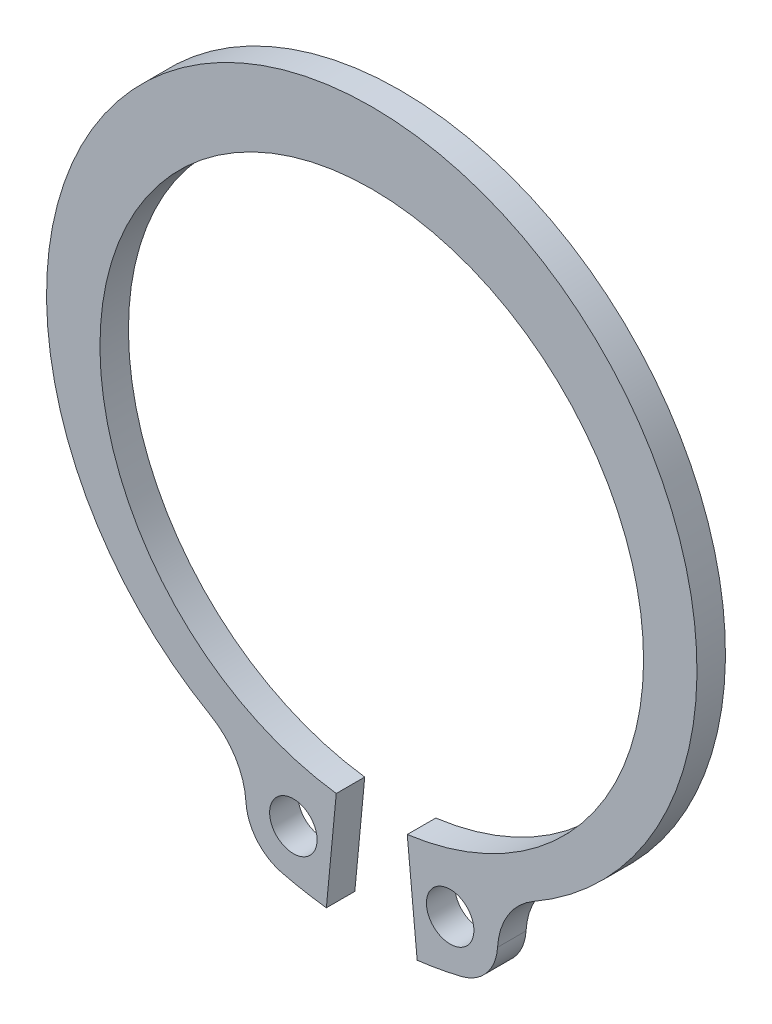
from build123d import *

# Parameters (mm, degrees)
ESQUISSE1_R          = 1
BASE_EXTRUSION_DEPTH = 1.2


with BuildPart() as part:
    # Esquisse1 → Base-Extrusion (new body)
    with BuildSketch(Plane.XY):
        with BuildLine():
            Line((1.495360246, -11.351933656), (1.912422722, -15.732123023))
            ThreePointArc((1.912422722, -15.732123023), (2.850897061, -15.589401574), (3.779142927, -15.390748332))
            ThreePointArc((3.779142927, -15.390748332), (4.83871543, -14.728747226), (5.298692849, -13.567127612))
            ThreePointArc((5.298692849, -13.567127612), (5.744086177, -12.163706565), (6.803572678, -11.141232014))
            ThreePointArc((6.803572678, -11.141232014), (0, 14.45), (-6.803572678, -11.141232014))
            ThreePointArc((-6.803572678, -11.141232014), (-5.744086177, -12.163706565), (-5.298692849, -13.567127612))
            ThreePointArc((-5.298692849, -13.567127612), (-4.83871543, -14.728747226), (-3.779142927, -15.390748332))
            ThreePointArc((-3.779142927, -15.390748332), (-2.850897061, -15.589401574), (-1.912422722, -15.732123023))
            Line((-1.912422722, -15.732123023), (-1.495360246, -11.351933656))
            ThreePointArc((-1.495360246, -11.351933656), (0, 11.45), (1.495360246, -11.351933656))
        make_face()
        with Locations((3.302217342, -13.448445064)):
            Circle(ESQUISSE1_R, mode=Mode.SUBTRACT)
        with Locations(Location((-3.302217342, -13.448445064, 0), (0, 0, 180))):
            Circle(ESQUISSE1_R, mode=Mode.SUBTRACT)
    extrude(amount=BASE_EXTRUSION_DEPTH)


solid = part.part
